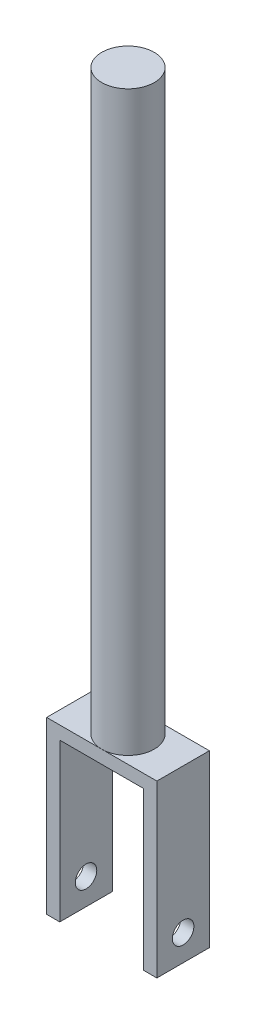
ISO-10303-21;
HEADER;
FILE_DESCRIPTION(('STEP AP214'),'2;1');
FILE_NAME('part.step','',(''),(''),'','','');
FILE_SCHEMA(('AUTOMOTIVE_DESIGN { 1 0 10303 214 1 1 1 1 }'));
ENDSEC;
DATA;
#1=APPLICATION_CONTEXT('core data for automotive mechanical design processes');
#2=APPLICATION_PROTOCOL_DEFINITION('international standard','automotive_design',2000,#1);
#3=PRODUCT_CONTEXT('',#1,'mechanical');
#4=PRODUCT('Part','Part','',(#3));
#5=PRODUCT_RELATED_PRODUCT_CATEGORY('part','',(#4));
#6=PRODUCT_DEFINITION_FORMATION('','',#4);
#7=PRODUCT_DEFINITION_CONTEXT('part definition',#1,'design');
#8=PRODUCT_DEFINITION('design','',#6,#7);
#9=PRODUCT_DEFINITION_SHAPE('','',#8);
#10=(LENGTH_UNIT() NAMED_UNIT(*) SI_UNIT(.MILLI.,.METRE.));
#11=(NAMED_UNIT(*) PLANE_ANGLE_UNIT() SI_UNIT($,.RADIAN.));
#12=(NAMED_UNIT(*) SI_UNIT($,.STERADIAN.) SOLID_ANGLE_UNIT());
#13=UNCERTAINTY_MEASURE_WITH_UNIT(LENGTH_MEASURE(1.E-05),#10,'distance_accuracy_value','');
#14=(GEOMETRIC_REPRESENTATION_CONTEXT(3) GLOBAL_UNCERTAINTY_ASSIGNED_CONTEXT((#13)) GLOBAL_UNIT_ASSIGNED_CONTEXT((#10,
#11,#12)) REPRESENTATION_CONTEXT('',''));
#15=CARTESIAN_POINT('',(0.,0.,0.));
#16=DIRECTION('',(0.,0.,1.));
#17=DIRECTION('',(1.,0.,0.));
#18=AXIS2_PLACEMENT_3D('',#15,#16,#17);
#19=CARTESIAN_POINT('',(0.,25.,5.));
#20=DIRECTION('',(0.,-1.,0.));
#21=DIRECTION('',(0.,0.,-1.));
#22=AXIS2_PLACEMENT_3D('',#19,#20,#21);
#23=PLANE('',#22);
#24=DIRECTION('',(-1.,0.,0.));
#25=VECTOR('',#24,1.);
#26=CARTESIAN_POINT('',(0.,25.,5.));
#27=LINE('',#26,#25);
#28=CARTESIAN_POINT('',(8.,25.,5.));
#29=VERTEX_POINT('',#28);
#30=CARTESIAN_POINT('',(-8.,25.,5.));
#31=VERTEX_POINT('',#30);
#32=EDGE_CURVE('E174',#29,#31,#27,.T.);
#33=ORIENTED_EDGE('',*,*,#32,.T.);
#34=DIRECTION('',(0.,0.,-1.));
#35=VECTOR('',#34,1.);
#36=CARTESIAN_POINT('',(-8.,25.,5.));
#37=LINE('',#36,#35);
#38=CARTESIAN_POINT('',(-8.,25.,-5.));
#39=VERTEX_POINT('',#38);
#40=EDGE_CURVE('E188',#31,#39,#37,.T.);
#41=ORIENTED_EDGE('',*,*,#40,.T.);
#42=DIRECTION('',(-1.,0.,0.));
#43=VECTOR('',#42,1.);
#44=CARTESIAN_POINT('',(0.,25.,-5.));
#45=LINE('',#44,#43);
#46=CARTESIAN_POINT('',(8.,25.,-5.));
#47=VERTEX_POINT('',#46);
#48=EDGE_CURVE('E189',#47,#39,#45,.T.);
#49=ORIENTED_EDGE('',*,*,#48,.F.);
#50=DIRECTION('',(0.,0.,-1.));
#51=VECTOR('',#50,1.);
#52=CARTESIAN_POINT('',(8.,25.,5.));
#53=LINE('',#52,#51);
#54=EDGE_CURVE('E217',#29,#47,#53,.T.);
#55=ORIENTED_EDGE('',*,*,#54,.F.);
#56=EDGE_LOOP('',(#33,#41,#49,#55));
#57=FACE_BOUND('',#56,.T.);
#58=ADVANCED_FACE('F51',(#57),#23,.T.);
#59=CARTESIAN_POINT('',(0.,27.5,5.));
#60=DIRECTION('',(0.,-1.,0.));
#61=DIRECTION('',(0.,0.,-1.));
#62=AXIS2_PLACEMENT_3D('',#59,#60,#61);
#63=PLANE('',#62);
#64=DIRECTION('',(-1.,0.,0.));
#65=VECTOR('',#64,1.);
#66=CARTESIAN_POINT('',(0.,27.5,-5.));
#67=LINE('',#66,#65);
#68=CARTESIAN_POINT('',(10.5,27.5,-5.));
#69=VERTEX_POINT('',#68);
#70=CARTESIAN_POINT('',(0.,27.5,-5.));
#71=VERTEX_POINT('',#70);
#72=EDGE_CURVE('E199',#69,#71,#67,.T.);
#73=ORIENTED_EDGE('',*,*,#72,.T.);
#74=CARTESIAN_POINT('',(0.,27.5,0.));
#75=DIRECTION('',(0.,-1.,0.));
#76=DIRECTION('',(0.,0.,-1.));
#77=AXIS2_PLACEMENT_3D('',#74,#75,#76);
#78=CIRCLE('',#77,5.);
#79=CARTESIAN_POINT('',(0.,27.5,5.));
#80=VERTEX_POINT('',#79);
#81=EDGE_CURVE('E11',#71,#80,#78,.T.);
#82=ORIENTED_EDGE('',*,*,#81,.T.);
#83=DIRECTION('',(-1.,0.,0.));
#84=VECTOR('',#83,1.);
#85=CARTESIAN_POINT('',(0.,27.5,5.));
#86=LINE('',#85,#84);
#87=CARTESIAN_POINT('',(10.5,27.5,5.));
#88=VERTEX_POINT('',#87);
#89=EDGE_CURVE('E132',#88,#80,#86,.T.);
#90=ORIENTED_EDGE('',*,*,#89,.F.);
#91=DIRECTION('',(0.,0.,-1.));
#92=VECTOR('',#91,1.);
#93=CARTESIAN_POINT('',(10.5,27.5,5.));
#94=LINE('',#93,#92);
#95=EDGE_CURVE('E213',#88,#69,#94,.T.);
#96=ORIENTED_EDGE('',*,*,#95,.T.);
#97=EDGE_LOOP('',(#73,#82,#90,#96));
#98=FACE_BOUND('',#97,.T.);
#99=ADVANCED_FACE('F234',(#98),#63,.F.);
#100=CARTESIAN_POINT('',(0.,0.,5.));
#101=DIRECTION('',(0.,0.,1.));
#102=DIRECTION('',(1.,0.,0.));
#103=AXIS2_PLACEMENT_3D('',#100,#101,#102);
#104=PLANE('',#103);
#105=DIRECTION('',(0.,-1.,0.));
#106=VECTOR('',#105,1.);
#107=CARTESIAN_POINT('',(-8.,0.,5.));
#108=LINE('',#107,#106);
#109=CARTESIAN_POINT('',(-8.,-5.,5.));
#110=VERTEX_POINT('',#109);
#111=EDGE_CURVE('E131',#31,#110,#108,.T.);
#112=ORIENTED_EDGE('',*,*,#111,.F.);
#113=ORIENTED_EDGE('',*,*,#32,.F.);
#114=DIRECTION('',(0.,-1.,0.));
#115=VECTOR('',#114,1.);
#116=CARTESIAN_POINT('',(8.,0.,5.));
#117=LINE('',#116,#115);
#118=CARTESIAN_POINT('',(8.,-5.,5.));
#119=VERTEX_POINT('',#118);
#120=EDGE_CURVE('E177',#29,#119,#117,.T.);
#121=ORIENTED_EDGE('',*,*,#120,.T.);
#122=DIRECTION('',(1.,0.,0.));
#123=VECTOR('',#122,1.);
#124=CARTESIAN_POINT('',(10.5,-5.,5.));
#125=LINE('',#124,#123);
#126=CARTESIAN_POINT('',(10.5,-5.,5.));
#127=VERTEX_POINT('',#126);
#128=EDGE_CURVE('E149',#119,#127,#125,.T.);
#129=ORIENTED_EDGE('',*,*,#128,.T.);
#130=DIRECTION('',(0.,1.,0.));
#131=VECTOR('',#130,1.);
#132=CARTESIAN_POINT('',(10.5,0.,5.));
#133=LINE('',#132,#131);
#134=EDGE_CURVE('E181',#127,#88,#133,.T.);
#135=ORIENTED_EDGE('',*,*,#134,.T.);
#136=ORIENTED_EDGE('',*,*,#89,.T.);
#137=CARTESIAN_POINT('',(-10.5,27.5,5.));
#138=VERTEX_POINT('',#137);
#139=EDGE_CURVE('E126',#80,#138,#86,.T.);
#140=ORIENTED_EDGE('',*,*,#139,.T.);
#141=DIRECTION('',(0.,1.,0.));
#142=VECTOR('',#141,1.);
#143=CARTESIAN_POINT('',(-10.5,0.,5.));
#144=LINE('',#143,#142);
#145=CARTESIAN_POINT('',(-10.5,-5.,5.));
#146=VERTEX_POINT('',#145);
#147=EDGE_CURVE('E118',#146,#138,#144,.T.);
#148=ORIENTED_EDGE('',*,*,#147,.F.);
#149=DIRECTION('',(1.,0.,0.));
#150=VECTOR('',#149,1.);
#151=CARTESIAN_POINT('',(-10.5,-5.,5.));
#152=LINE('',#151,#150);
#153=EDGE_CURVE('E123',#146,#110,#152,.T.);
#154=ORIENTED_EDGE('',*,*,#153,.T.);
#155=EDGE_LOOP('',(#112,#113,#121,#129,#135,#136,#140,#148,#154));
#156=FACE_BOUND('',#155,.T.);
#157=ADVANCED_FACE('F121',(#156),#104,.T.);
#158=CARTESIAN_POINT('',(0.,0.,-5.));
#159=DIRECTION('',(0.,0.,1.));
#160=DIRECTION('',(1.,0.,0.));
#161=AXIS2_PLACEMENT_3D('',#158,#159,#160);
#162=PLANE('',#161);
#163=CARTESIAN_POINT('',(-10.5,27.5,-5.));
#164=VERTEX_POINT('',#163);
#165=EDGE_CURVE('E198',#71,#164,#67,.T.);
#166=ORIENTED_EDGE('',*,*,#165,.F.);
#167=ORIENTED_EDGE('',*,*,#72,.F.);
#168=DIRECTION('',(0.,1.,0.));
#169=VECTOR('',#168,1.);
#170=CARTESIAN_POINT('',(10.5,0.,-5.));
#171=LINE('',#170,#169);
#172=CARTESIAN_POINT('',(10.5,-5.,-5.));
#173=VERTEX_POINT('',#172);
#174=EDGE_CURVE('E195',#173,#69,#171,.T.);
#175=ORIENTED_EDGE('',*,*,#174,.F.);
#176=DIRECTION('',(-1.,0.,0.));
#177=VECTOR('',#176,1.);
#178=CARTESIAN_POINT('',(10.5,-5.,-5.));
#179=LINE('',#178,#177);
#180=CARTESIAN_POINT('',(8.,-5.,-5.));
#181=VERTEX_POINT('',#180);
#182=EDGE_CURVE('E168',#173,#181,#179,.T.);
#183=ORIENTED_EDGE('',*,*,#182,.T.);
#184=DIRECTION('',(0.,-1.,0.));
#185=VECTOR('',#184,1.);
#186=CARTESIAN_POINT('',(8.,0.,-5.));
#187=LINE('',#186,#185);
#188=EDGE_CURVE('E192',#47,#181,#187,.T.);
#189=ORIENTED_EDGE('',*,*,#188,.F.);
#190=ORIENTED_EDGE('',*,*,#48,.T.);
#191=DIRECTION('',(0.,-1.,0.));
#192=VECTOR('',#191,1.);
#193=CARTESIAN_POINT('',(-8.,0.,-5.));
#194=LINE('',#193,#192);
#195=CARTESIAN_POINT('',(-8.,-5.,-5.));
#196=VERTEX_POINT('',#195);
#197=EDGE_CURVE('E178',#39,#196,#194,.T.);
#198=ORIENTED_EDGE('',*,*,#197,.T.);
#199=DIRECTION('',(-1.,0.,0.));
#200=VECTOR('',#199,1.);
#201=CARTESIAN_POINT('',(-10.5,-5.,-5.));
#202=LINE('',#201,#200);
#203=CARTESIAN_POINT('',(-10.5,-5.,-5.));
#204=VERTEX_POINT('',#203);
#205=EDGE_CURVE('E158',#196,#204,#202,.T.);
#206=ORIENTED_EDGE('',*,*,#205,.T.);
#207=DIRECTION('',(0.,1.,0.));
#208=VECTOR('',#207,1.);
#209=CARTESIAN_POINT('',(-10.5,0.,-5.));
#210=LINE('',#209,#208);
#211=EDGE_CURVE('E138',#204,#164,#210,.T.);
#212=ORIENTED_EDGE('',*,*,#211,.T.);
#213=EDGE_LOOP('',(#166,#167,#175,#183,#189,#190,#198,#206,#212));
#214=FACE_BOUND('',#213,.T.);
#215=ADVANCED_FACE('F231',(#214),#162,.F.);
#216=CARTESIAN_POINT('',(8.,0.,5.));
#217=DIRECTION('',(1.,0.,0.));
#218=DIRECTION('',(0.,0.,-1.));
#219=AXIS2_PLACEMENT_3D('',#216,#217,#218);
#220=PLANE('',#219);
#221=CARTESIAN_POINT('',(8.,0.,0.));
#222=DIRECTION('',(1.,0.,0.));
#223=DIRECTION('',(0.,0.,-1.));
#224=AXIS2_PLACEMENT_3D('',#221,#222,#223);
#225=CIRCLE('',#224,2.05);
#226=CARTESIAN_POINT('',(8.,0.,-2.05));
#227=VERTEX_POINT('',#226);
#228=EDGE_CURVE('E173',#227,#227,#225,.T.);
#229=ORIENTED_EDGE('',*,*,#228,.T.);
#230=EDGE_LOOP('',(#229));
#231=FACE_BOUND('',#230,.T.);
#232=ORIENTED_EDGE('',*,*,#188,.T.);
#233=DIRECTION('',(0.,0.,1.));
#234=VECTOR('',#233,1.);
#235=CARTESIAN_POINT('',(8.,-5.,-10.5901699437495));
#236=LINE('',#235,#234);
#237=EDGE_CURVE('E154',#181,#119,#236,.T.);
#238=ORIENTED_EDGE('',*,*,#237,.T.);
#239=ORIENTED_EDGE('',*,*,#120,.F.);
#240=ORIENTED_EDGE('',*,*,#54,.T.);
#241=EDGE_LOOP('',(#232,#238,#239,#240));
#242=FACE_BOUND('',#241,.T.);
#243=ADVANCED_FACE('F248',(#231,#242),#220,.F.);
#244=CARTESIAN_POINT('',(10.5,0.,5.));
#245=DIRECTION('',(-1.,0.,0.));
#246=DIRECTION('',(0.,0.,1.));
#247=AXIS2_PLACEMENT_3D('',#244,#245,#246);
#248=PLANE('',#247);
#249=CARTESIAN_POINT('',(10.5,0.,0.));
#250=DIRECTION('',(-1.,0.,0.));
#251=DIRECTION('',(0.,0.,1.));
#252=AXIS2_PLACEMENT_3D('',#249,#250,#251);
#253=CIRCLE('',#252,2.05);
#254=CARTESIAN_POINT('',(10.5,0.,2.05));
#255=VERTEX_POINT('',#254);
#256=EDGE_CURVE('E386',#255,#255,#253,.T.);
#257=ORIENTED_EDGE('',*,*,#256,.T.);
#258=EDGE_LOOP('',(#257));
#259=FACE_BOUND('',#258,.T.);
#260=ORIENTED_EDGE('',*,*,#174,.T.);
#261=ORIENTED_EDGE('',*,*,#95,.F.);
#262=ORIENTED_EDGE('',*,*,#134,.F.);
#263=DIRECTION('',(0.,0.,1.));
#264=VECTOR('',#263,1.);
#265=CARTESIAN_POINT('',(10.5,-5.,-10.5901699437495));
#266=LINE('',#265,#264);
#267=EDGE_CURVE('E165',#173,#127,#266,.T.);
#268=ORIENTED_EDGE('',*,*,#267,.F.);
#269=EDGE_LOOP('',(#260,#261,#262,#268));
#270=FACE_BOUND('',#269,.T.);
#271=ADVANCED_FACE('F238',(#259,#270),#248,.F.);
#272=ORIENTED_EDGE('',*,*,#139,.F.);
#273=EDGE_CURVE('E61',#80,#71,#78,.T.);
#274=ORIENTED_EDGE('',*,*,#273,.T.);
#275=ORIENTED_EDGE('',*,*,#165,.T.);
#276=DIRECTION('',(0.,0.,-1.));
#277=VECTOR('',#276,1.);
#278=CARTESIAN_POINT('',(-10.5,27.5,5.));
#279=LINE('',#278,#277);
#280=EDGE_CURVE('E210',#138,#164,#279,.T.);
#281=ORIENTED_EDGE('',*,*,#280,.F.);
#282=EDGE_LOOP('',(#272,#274,#275,#281));
#283=FACE_BOUND('',#282,.T.);
#284=ADVANCED_FACE('F228',(#283),#63,.F.);
#285=CARTESIAN_POINT('',(-10.5,0.,5.));
#286=DIRECTION('',(-1.,0.,0.));
#287=DIRECTION('',(0.,0.,1.));
#288=AXIS2_PLACEMENT_3D('',#285,#286,#287);
#289=PLANE('',#288);
#290=CARTESIAN_POINT('',(-10.5,0.,0.));
#291=DIRECTION('',(-1.,0.,0.));
#292=DIRECTION('',(0.,0.,1.));
#293=AXIS2_PLACEMENT_3D('',#290,#291,#292);
#294=CIRCLE('',#293,2.05);
#295=CARTESIAN_POINT('',(-10.5,0.,2.05));
#296=VERTEX_POINT('',#295);
#297=EDGE_CURVE('E390',#296,#296,#294,.T.);
#298=ORIENTED_EDGE('',*,*,#297,.F.);
#299=EDGE_LOOP('',(#298));
#300=FACE_BOUND('',#299,.T.);
#301=ORIENTED_EDGE('',*,*,#211,.F.);
#302=DIRECTION('',(0.,0.,1.));
#303=VECTOR('',#302,1.);
#304=CARTESIAN_POINT('',(-10.5,-5.,-10.5901699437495));
#305=LINE('',#304,#303);
#306=EDGE_CURVE('E135',#204,#146,#305,.T.);
#307=ORIENTED_EDGE('',*,*,#306,.T.);
#308=ORIENTED_EDGE('',*,*,#147,.T.);
#309=ORIENTED_EDGE('',*,*,#280,.T.);
#310=EDGE_LOOP('',(#301,#307,#308,#309));
#311=FACE_BOUND('',#310,.T.);
#312=ADVANCED_FACE('F136',(#300,#311),#289,.T.);
#313=CARTESIAN_POINT('',(-8.,0.,5.));
#314=DIRECTION('',(1.,0.,0.));
#315=DIRECTION('',(0.,0.,-1.));
#316=AXIS2_PLACEMENT_3D('',#313,#314,#315);
#317=PLANE('',#316);
#318=CARTESIAN_POINT('',(-8.,0.,0.));
#319=DIRECTION('',(1.,0.,0.));
#320=DIRECTION('',(0.,0.,-1.));
#321=AXIS2_PLACEMENT_3D('',#318,#319,#320);
#322=CIRCLE('',#321,2.05);
#323=CARTESIAN_POINT('',(-8.,0.,-2.05));
#324=VERTEX_POINT('',#323);
#325=EDGE_CURVE('E55',#324,#324,#322,.T.);
#326=ORIENTED_EDGE('',*,*,#325,.F.);
#327=EDGE_LOOP('',(#326));
#328=FACE_BOUND('',#327,.T.);
#329=ORIENTED_EDGE('',*,*,#197,.F.);
#330=ORIENTED_EDGE('',*,*,#40,.F.);
#331=ORIENTED_EDGE('',*,*,#111,.T.);
#332=DIRECTION('',(0.,0.,1.));
#333=VECTOR('',#332,1.);
#334=CARTESIAN_POINT('',(-8.,-5.,-10.5901699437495));
#335=LINE('',#334,#333);
#336=EDGE_CURVE('E143',#196,#110,#335,.T.);
#337=ORIENTED_EDGE('',*,*,#336,.F.);
#338=EDGE_LOOP('',(#329,#330,#331,#337));
#339=FACE_BOUND('',#338,.T.);
#340=ADVANCED_FACE('F254',(#328,#339),#317,.T.);
#341=CARTESIAN_POINT('',(0.,137.5,0.));
#342=DIRECTION('',(0.,1.,0.));
#343=DIRECTION('',(0.,0.,1.));
#344=AXIS2_PLACEMENT_3D('',#341,#342,#343);
#345=PLANE('',#344);
#346=CARTESIAN_POINT('',(0.,137.5,0.));
#347=DIRECTION('',(0.,1.,0.));
#348=DIRECTION('',(0.,0.,1.));
#349=AXIS2_PLACEMENT_3D('',#346,#347,#348);
#350=CIRCLE('',#349,5.);
#351=CARTESIAN_POINT('',(0.,137.5,5.));
#352=VERTEX_POINT('',#351);
#353=EDGE_CURVE('E221',#352,#352,#350,.T.);
#354=ORIENTED_EDGE('',*,*,#353,.T.);
#355=EDGE_LOOP('',(#354));
#356=FACE_BOUND('',#355,.T.);
#357=ADVANCED_FACE('F256',(#356),#345,.T.);
#358=CARTESIAN_POINT('',(0.,137.5,0.));
#359=DIRECTION('',(0.,-1.,0.));
#360=DIRECTION('',(0.,0.,-1.));
#361=AXIS2_PLACEMENT_3D('',#358,#359,#360);
#362=CYLINDRICAL_SURFACE('',#361,5.);
#363=ORIENTED_EDGE('',*,*,#353,.F.);
#364=EDGE_LOOP('',(#363));
#365=FACE_BOUND('',#364,.T.);
#366=ORIENTED_EDGE('',*,*,#81,.F.);
#367=ORIENTED_EDGE('',*,*,#273,.F.);
#368=EDGE_LOOP('',(#366,#367));
#369=FACE_BOUND('',#368,.T.);
#370=ADVANCED_FACE('F53',(#365,#369),#362,.T.);
#371=CARTESIAN_POINT('',(-10.5,-5.,-10.5901699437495));
#372=DIRECTION('',(0.,-1.,0.));
#373=DIRECTION('',(0.,0.,-1.));
#374=AXIS2_PLACEMENT_3D('',#371,#372,#373);
#375=PLANE('',#374);
#376=ORIENTED_EDGE('',*,*,#205,.F.);
#377=ORIENTED_EDGE('',*,*,#336,.T.);
#378=ORIENTED_EDGE('',*,*,#153,.F.);
#379=ORIENTED_EDGE('',*,*,#306,.F.);
#380=EDGE_LOOP('',(#376,#377,#378,#379));
#381=FACE_BOUND('',#380,.T.);
#382=ADVANCED_FACE('F146',(#381),#375,.T.);
#383=CARTESIAN_POINT('',(10.5,-5.,-10.5901699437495));
#384=DIRECTION('',(0.,-1.,0.));
#385=DIRECTION('',(0.,0.,-1.));
#386=AXIS2_PLACEMENT_3D('',#383,#384,#385);
#387=PLANE('',#386);
#388=ORIENTED_EDGE('',*,*,#182,.F.);
#389=ORIENTED_EDGE('',*,*,#267,.T.);
#390=ORIENTED_EDGE('',*,*,#128,.F.);
#391=ORIENTED_EDGE('',*,*,#237,.F.);
#392=EDGE_LOOP('',(#388,#389,#390,#391));
#393=FACE_BOUND('',#392,.T.);
#394=ADVANCED_FACE('F244',(#393),#387,.T.);
#395=CARTESIAN_POINT('',(10.5,0.,0.));
#396=DIRECTION('',(-1.,0.,0.));
#397=DIRECTION('',(0.,0.,1.));
#398=AXIS2_PLACEMENT_3D('',#395,#396,#397);
#399=CYLINDRICAL_SURFACE('',#398,2.05);
#400=ORIENTED_EDGE('',*,*,#297,.T.);
#401=EDGE_LOOP('',(#400));
#402=FACE_BOUND('',#401,.T.);
#403=ORIENTED_EDGE('',*,*,#325,.T.);
#404=EDGE_LOOP('',(#403));
#405=FACE_BOUND('',#404,.T.);
#406=ADVANCED_FACE('F363',(#402,#405),#399,.F.);
#407=ORIENTED_EDGE('',*,*,#256,.F.);
#408=EDGE_LOOP('',(#407));
#409=FACE_BOUND('',#408,.T.);
#410=ORIENTED_EDGE('',*,*,#228,.F.);
#411=EDGE_LOOP('',(#410));
#412=FACE_BOUND('',#411,.T.);
#413=ADVANCED_FACE('F370',(#409,#412),#399,.F.);
#414=CLOSED_SHELL('',(#58,#99,#157,#215,#243,#271,#284,#312,#340,#357,#370,#382,#394,#406,#413));
#415=MANIFOLD_SOLID_BREP('B2',#414);
#416=ADVANCED_BREP_SHAPE_REPRESENTATION('',(#18,#415),#14);
#417=SHAPE_DEFINITION_REPRESENTATION(#9,#416);
ENDSEC;
END-ISO-10303-21;
